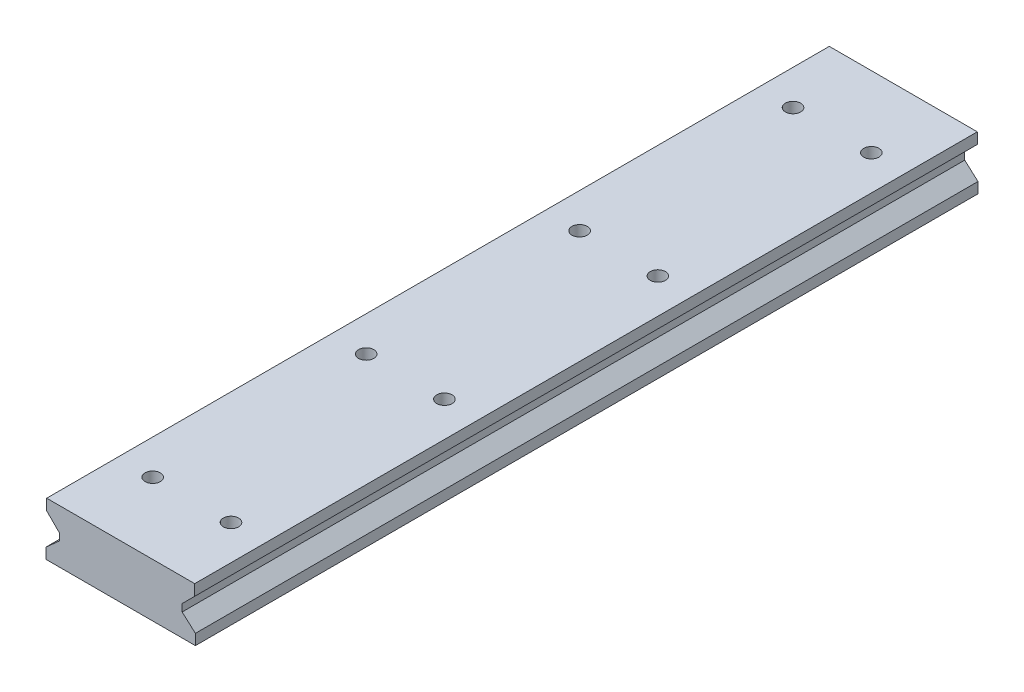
ISO-10303-21;
HEADER;
FILE_DESCRIPTION(('STEP AP214'),'2;1');
FILE_NAME('part.step','',(''),(''),'','','');
FILE_SCHEMA(('AUTOMOTIVE_DESIGN { 1 0 10303 214 1 1 1 1 }'));
ENDSEC;
DATA;
#1=APPLICATION_CONTEXT('core data for automotive mechanical design processes');
#2=APPLICATION_PROTOCOL_DEFINITION('international standard','automotive_design',2000,#1);
#3=PRODUCT_CONTEXT('',#1,'mechanical');
#4=PRODUCT('Part','Part','',(#3));
#5=PRODUCT_RELATED_PRODUCT_CATEGORY('part','',(#4));
#6=PRODUCT_DEFINITION_FORMATION('','',#4);
#7=PRODUCT_DEFINITION_CONTEXT('part definition',#1,'design');
#8=PRODUCT_DEFINITION('design','',#6,#7);
#9=PRODUCT_DEFINITION_SHAPE('','',#8);
#10=(LENGTH_UNIT() NAMED_UNIT(*) SI_UNIT(.MILLI.,.METRE.));
#11=(NAMED_UNIT(*) PLANE_ANGLE_UNIT() SI_UNIT($,.RADIAN.));
#12=(NAMED_UNIT(*) SI_UNIT($,.STERADIAN.) SOLID_ANGLE_UNIT());
#13=UNCERTAINTY_MEASURE_WITH_UNIT(LENGTH_MEASURE(1.E-05),#10,'distance_accuracy_value','');
#14=(GEOMETRIC_REPRESENTATION_CONTEXT(3) GLOBAL_UNCERTAINTY_ASSIGNED_CONTEXT((#13)) GLOBAL_UNIT_ASSIGNED_CONTEXT((#10,
#11,#12)) REPRESENTATION_CONTEXT('',''));
#15=CARTESIAN_POINT('',(0.,0.,0.));
#16=DIRECTION('',(0.,0.,1.));
#17=DIRECTION('',(1.,0.,0.));
#18=AXIS2_PLACEMENT_3D('',#15,#16,#17);
#19=CARTESIAN_POINT('',(-21.,0.,220.));
#20=DIRECTION('',(1.,0.,0.));
#21=DIRECTION('',(0.,0.,-1.));
#22=AXIS2_PLACEMENT_3D('',#19,#20,#21);
#23=PLANE('',#22);
#24=DIRECTION('',(0.,-1.,0.));
#25=VECTOR('',#24,1.);
#26=CARTESIAN_POINT('',(-21.,0.,0.));
#27=LINE('',#26,#25);
#28=CARTESIAN_POINT('',(-21.,3.,0.));
#29=VERTEX_POINT('',#28);
#30=CARTESIAN_POINT('',(-21.,0.,0.));
#31=VERTEX_POINT('',#30);
#32=EDGE_CURVE('E156',#29,#31,#27,.T.);
#33=ORIENTED_EDGE('',*,*,#32,.T.);
#34=DIRECTION('',(0.,0.,-1.));
#35=VECTOR('',#34,1.);
#36=CARTESIAN_POINT('',(-21.,0.,220.));
#37=LINE('',#36,#35);
#38=CARTESIAN_POINT('',(-21.,0.,220.));
#39=VERTEX_POINT('',#38);
#40=EDGE_CURVE('E204',#39,#31,#37,.T.);
#41=ORIENTED_EDGE('',*,*,#40,.F.);
#42=DIRECTION('',(0.,-1.,0.));
#43=VECTOR('',#42,1.);
#44=CARTESIAN_POINT('',(-21.,0.,220.));
#45=LINE('',#44,#43);
#46=CARTESIAN_POINT('',(-21.,3.,220.));
#47=VERTEX_POINT('',#46);
#48=EDGE_CURVE('E179',#47,#39,#45,.T.);
#49=ORIENTED_EDGE('',*,*,#48,.F.);
#50=DIRECTION('',(0.,0.,-1.));
#51=VECTOR('',#50,1.);
#52=CARTESIAN_POINT('',(-21.,3.,220.));
#53=LINE('',#52,#51);
#54=EDGE_CURVE('E152',#47,#29,#53,.T.);
#55=ORIENTED_EDGE('',*,*,#54,.T.);
#56=EDGE_LOOP('',(#33,#41,#49,#55));
#57=FACE_BOUND('',#56,.T.);
#58=ADVANCED_FACE('F34',(#57),#23,.F.);
#59=CARTESIAN_POINT('',(21.,0.,220.));
#60=DIRECTION('',(0.,1.,0.));
#61=DIRECTION('',(0.,0.,1.));
#62=AXIS2_PLACEMENT_3D('',#59,#60,#61);
#63=PLANE('',#62);
#64=CARTESIAN_POINT('',(-11.,0.,140.));
#65=DIRECTION('',(0.,-1.,0.));
#66=DIRECTION('',(0.,0.,-1.));
#67=AXIS2_PLACEMENT_3D('',#64,#65,#66);
#68=CIRCLE('',#67,2.15000000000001);
#69=CARTESIAN_POINT('',(-11.,0.,137.85));
#70=VERTEX_POINT('',#69);
#71=EDGE_CURVE('E352',#70,#70,#68,.T.);
#72=ORIENTED_EDGE('',*,*,#71,.F.);
#73=EDGE_LOOP('',(#72));
#74=FACE_BOUND('',#73,.T.);
#75=CARTESIAN_POINT('',(11.,0.,140.));
#76=DIRECTION('',(0.,-1.,0.));
#77=DIRECTION('',(0.,0.,-1.));
#78=AXIS2_PLACEMENT_3D('',#75,#76,#77);
#79=CIRCLE('',#78,2.15000000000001);
#80=CARTESIAN_POINT('',(11.,0.,137.85));
#81=VERTEX_POINT('',#80);
#82=EDGE_CURVE('E347',#81,#81,#79,.T.);
#83=ORIENTED_EDGE('',*,*,#82,.F.);
#84=EDGE_LOOP('',(#83));
#85=FACE_BOUND('',#84,.T.);
#86=CARTESIAN_POINT('',(11.,0.,200.));
#87=DIRECTION('',(0.,-1.,0.));
#88=DIRECTION('',(0.,0.,-1.));
#89=AXIS2_PLACEMENT_3D('',#86,#87,#88);
#90=CIRCLE('',#89,2.15000000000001);
#91=CARTESIAN_POINT('',(11.,0.,197.85));
#92=VERTEX_POINT('',#91);
#93=EDGE_CURVE('E213',#92,#92,#90,.T.);
#94=ORIENTED_EDGE('',*,*,#93,.F.);
#95=EDGE_LOOP('',(#94));
#96=FACE_BOUND('',#95,.T.);
#97=CARTESIAN_POINT('',(-11.,0.,200.));
#98=DIRECTION('',(0.,-1.,0.));
#99=DIRECTION('',(0.,0.,-1.));
#100=AXIS2_PLACEMENT_3D('',#97,#98,#99);
#101=CIRCLE('',#100,2.15000000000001);
#102=CARTESIAN_POINT('',(-11.,0.,197.85));
#103=VERTEX_POINT('',#102);
#104=EDGE_CURVE('E209',#103,#103,#101,.T.);
#105=ORIENTED_EDGE('',*,*,#104,.F.);
#106=EDGE_LOOP('',(#105));
#107=FACE_BOUND('',#106,.T.);
#108=DIRECTION('',(1.,0.,0.));
#109=VECTOR('',#108,1.);
#110=CARTESIAN_POINT('',(21.,0.,0.));
#111=LINE('',#110,#109);
#112=CARTESIAN_POINT('',(21.,0.,0.));
#113=VERTEX_POINT('',#112);
#114=EDGE_CURVE('E159',#31,#113,#111,.T.);
#115=ORIENTED_EDGE('',*,*,#114,.T.);
#116=DIRECTION('',(0.,0.,-1.));
#117=VECTOR('',#116,1.);
#118=CARTESIAN_POINT('',(21.,0.,220.));
#119=LINE('',#118,#117);
#120=CARTESIAN_POINT('',(21.,0.,220.));
#121=VERTEX_POINT('',#120);
#122=EDGE_CURVE('E201',#121,#113,#119,.T.);
#123=ORIENTED_EDGE('',*,*,#122,.F.);
#124=DIRECTION('',(1.,0.,0.));
#125=VECTOR('',#124,1.);
#126=CARTESIAN_POINT('',(21.,0.,220.));
#127=LINE('',#126,#125);
#128=EDGE_CURVE('E107',#39,#121,#127,.T.);
#129=ORIENTED_EDGE('',*,*,#128,.F.);
#130=ORIENTED_EDGE('',*,*,#40,.T.);
#131=EDGE_LOOP('',(#115,#123,#129,#130));
#132=FACE_BOUND('',#131,.T.);
#133=CARTESIAN_POINT('',(11.,0.,80.));
#134=DIRECTION('',(0.,-1.,0.));
#135=DIRECTION('',(0.,0.,-1.));
#136=AXIS2_PLACEMENT_3D('',#133,#134,#135);
#137=CIRCLE('',#136,2.15000000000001);
#138=CARTESIAN_POINT('',(11.,0.,77.85));
#139=VERTEX_POINT('',#138);
#140=EDGE_CURVE('E206',#139,#139,#137,.T.);
#141=ORIENTED_EDGE('',*,*,#140,.F.);
#142=EDGE_LOOP('',(#141));
#143=FACE_BOUND('',#142,.T.);
#144=CARTESIAN_POINT('',(11.,0.,20.));
#145=DIRECTION('',(0.,-1.,0.));
#146=DIRECTION('',(0.,0.,-1.));
#147=AXIS2_PLACEMENT_3D('',#144,#145,#146);
#148=CIRCLE('',#147,2.15000000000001);
#149=CARTESIAN_POINT('',(11.,0.,17.85));
#150=VERTEX_POINT('',#149);
#151=EDGE_CURVE('E219',#150,#150,#148,.T.);
#152=ORIENTED_EDGE('',*,*,#151,.F.);
#153=EDGE_LOOP('',(#152));
#154=FACE_BOUND('',#153,.T.);
#155=CARTESIAN_POINT('',(-11.,0.,80.));
#156=DIRECTION('',(0.,-1.,0.));
#157=DIRECTION('',(0.,0.,-1.));
#158=AXIS2_PLACEMENT_3D('',#155,#156,#157);
#159=CIRCLE('',#158,2.15000000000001);
#160=CARTESIAN_POINT('',(-11.,0.,77.85));
#161=VERTEX_POINT('',#160);
#162=EDGE_CURVE('E225',#161,#161,#159,.T.);
#163=ORIENTED_EDGE('',*,*,#162,.F.);
#164=EDGE_LOOP('',(#163));
#165=FACE_BOUND('',#164,.T.);
#166=CARTESIAN_POINT('',(-11.,0.,20.));
#167=DIRECTION('',(0.,-1.,0.));
#168=DIRECTION('',(0.,0.,-1.));
#169=AXIS2_PLACEMENT_3D('',#166,#167,#168);
#170=CIRCLE('',#169,2.15000000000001);
#171=CARTESIAN_POINT('',(-11.,0.,17.85));
#172=VERTEX_POINT('',#171);
#173=EDGE_CURVE('E43',#172,#172,#170,.T.);
#174=ORIENTED_EDGE('',*,*,#173,.F.);
#175=EDGE_LOOP('',(#174));
#176=FACE_BOUND('',#175,.T.);
#177=ADVANCED_FACE('F235',(#74,#85,#96,#107,#132,#143,#154,#165,#176),#63,.F.);
#178=CARTESIAN_POINT('',(21.,0.,220.));
#179=DIRECTION('',(-1.,0.,0.));
#180=DIRECTION('',(0.,0.,1.));
#181=AXIS2_PLACEMENT_3D('',#178,#179,#180);
#182=PLANE('',#181);
#183=DIRECTION('',(0.,1.,0.));
#184=VECTOR('',#183,1.);
#185=CARTESIAN_POINT('',(21.,0.,0.));
#186=LINE('',#185,#184);
#187=CARTESIAN_POINT('',(21.,3.,0.));
#188=VERTEX_POINT('',#187);
#189=EDGE_CURVE('E162',#113,#188,#186,.T.);
#190=ORIENTED_EDGE('',*,*,#189,.T.);
#191=DIRECTION('',(0.,0.,-1.));
#192=VECTOR('',#191,1.);
#193=CARTESIAN_POINT('',(21.,3.,220.));
#194=LINE('',#193,#192);
#195=CARTESIAN_POINT('',(21.,3.,220.));
#196=VERTEX_POINT('',#195);
#197=EDGE_CURVE('E198',#196,#188,#194,.T.);
#198=ORIENTED_EDGE('',*,*,#197,.F.);
#199=DIRECTION('',(0.,1.,0.));
#200=VECTOR('',#199,1.);
#201=CARTESIAN_POINT('',(21.,0.,220.));
#202=LINE('',#201,#200);
#203=EDGE_CURVE('E336',#121,#196,#202,.T.);
#204=ORIENTED_EDGE('',*,*,#203,.F.);
#205=ORIENTED_EDGE('',*,*,#122,.T.);
#206=EDGE_LOOP('',(#190,#198,#204,#205));
#207=FACE_BOUND('',#206,.T.);
#208=ADVANCED_FACE('F237',(#207),#182,.F.);
#209=CARTESIAN_POINT('',(17.2689267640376,6.32852707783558,220.));
#210=DIRECTION('',(-0.665705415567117,-0.74621464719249,0.));
#211=DIRECTION('',(0.74621464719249,-0.665705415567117,0.));
#212=AXIS2_PLACEMENT_3D('',#209,#210,#211);
#213=PLANE('',#212);
#214=DIRECTION('',(-0.74621464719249,0.665705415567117,0.));
#215=VECTOR('',#214,1.);
#216=CARTESIAN_POINT('',(17.2689267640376,6.32852707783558,0.));
#217=LINE('',#216,#215);
#218=CARTESIAN_POINT('',(17.2689267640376,6.32852707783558,0.));
#219=VERTEX_POINT('',#218);
#220=EDGE_CURVE('E164',#188,#219,#217,.T.);
#221=ORIENTED_EDGE('',*,*,#220,.T.);
#222=DIRECTION('',(0.,0.,-1.));
#223=VECTOR('',#222,1.);
#224=CARTESIAN_POINT('',(17.2689267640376,6.32852707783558,220.));
#225=LINE('',#224,#223);
#226=CARTESIAN_POINT('',(17.2689267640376,6.32852707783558,220.));
#227=VERTEX_POINT('',#226);
#228=EDGE_CURVE('E195',#227,#219,#225,.T.);
#229=ORIENTED_EDGE('',*,*,#228,.F.);
#230=DIRECTION('',(-0.74621464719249,0.665705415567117,0.));
#231=VECTOR('',#230,1.);
#232=CARTESIAN_POINT('',(17.2689267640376,6.32852707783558,220.));
#233=LINE('',#232,#231);
#234=EDGE_CURVE('E334',#196,#227,#233,.T.);
#235=ORIENTED_EDGE('',*,*,#234,.F.);
#236=ORIENTED_EDGE('',*,*,#197,.T.);
#237=EDGE_LOOP('',(#221,#229,#235,#236));
#238=FACE_BOUND('',#237,.T.);
#239=ADVANCED_FACE('F244',(#238),#213,.F.);
#240=CARTESIAN_POINT('',(17.2689267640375,8.38189648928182,220.));
#241=DIRECTION('',(-1.,0.,0.));
#242=DIRECTION('',(0.,-1.,0.));
#243=AXIS2_PLACEMENT_3D('',#240,#241,#242);
#244=PLANE('',#243);
#245=DIRECTION('',(0.,1.,0.));
#246=VECTOR('',#245,1.);
#247=CARTESIAN_POINT('',(17.2689267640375,8.38189648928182,0.));
#248=LINE('',#247,#246);
#249=CARTESIAN_POINT('',(17.2689267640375,8.38189648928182,0.));
#250=VERTEX_POINT('',#249);
#251=EDGE_CURVE('E166',#219,#250,#248,.T.);
#252=ORIENTED_EDGE('',*,*,#251,.T.);
#253=DIRECTION('',(0.,0.,-1.));
#254=VECTOR('',#253,1.);
#255=CARTESIAN_POINT('',(17.2689267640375,8.38189648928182,220.));
#256=LINE('',#255,#254);
#257=CARTESIAN_POINT('',(17.2689267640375,8.38189648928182,220.));
#258=VERTEX_POINT('',#257);
#259=EDGE_CURVE('E192',#258,#250,#256,.T.);
#260=ORIENTED_EDGE('',*,*,#259,.F.);
#261=DIRECTION('',(0.,1.,0.));
#262=VECTOR('',#261,1.);
#263=CARTESIAN_POINT('',(17.2689267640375,8.38189648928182,220.));
#264=LINE('',#263,#262);
#265=EDGE_CURVE('E315',#227,#258,#264,.T.);
#266=ORIENTED_EDGE('',*,*,#265,.F.);
#267=ORIENTED_EDGE('',*,*,#228,.T.);
#268=EDGE_LOOP('',(#252,#260,#266,#267));
#269=FACE_BOUND('',#268,.T.);
#270=ADVANCED_FACE('F298',(#269),#244,.F.);
#271=CARTESIAN_POINT('',(20.8044606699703,11.9174303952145,220.));
#272=DIRECTION('',(-0.707106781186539,0.707106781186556,0.));
#273=DIRECTION('',(-0.707106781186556,-0.707106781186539,0.));
#274=AXIS2_PLACEMENT_3D('',#271,#272,#273);
#275=PLANE('',#274);
#276=DIRECTION('',(0.707106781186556,0.707106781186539,0.));
#277=VECTOR('',#276,1.);
#278=CARTESIAN_POINT('',(20.8044606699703,11.9174303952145,0.));
#279=LINE('',#278,#277);
#280=CARTESIAN_POINT('',(20.8044606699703,11.9174303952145,0.));
#281=VERTEX_POINT('',#280);
#282=EDGE_CURVE('E168',#250,#281,#279,.T.);
#283=ORIENTED_EDGE('',*,*,#282,.T.);
#284=DIRECTION('',(0.,0.,-1.));
#285=VECTOR('',#284,1.);
#286=CARTESIAN_POINT('',(20.8044606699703,11.9174303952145,220.));
#287=LINE('',#286,#285);
#288=CARTESIAN_POINT('',(20.8044606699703,11.9174303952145,220.));
#289=VERTEX_POINT('',#288);
#290=EDGE_CURVE('E189',#289,#281,#287,.T.);
#291=ORIENTED_EDGE('',*,*,#290,.F.);
#292=DIRECTION('',(0.707106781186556,0.707106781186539,0.));
#293=VECTOR('',#292,1.);
#294=CARTESIAN_POINT('',(20.8044606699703,11.9174303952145,220.));
#295=LINE('',#294,#293);
#296=EDGE_CURVE('E328',#258,#289,#295,.T.);
#297=ORIENTED_EDGE('',*,*,#296,.F.);
#298=ORIENTED_EDGE('',*,*,#259,.T.);
#299=EDGE_LOOP('',(#283,#291,#297,#298));
#300=FACE_BOUND('',#299,.T.);
#301=ADVANCED_FACE('F289',(#300),#275,.F.);
#302=CARTESIAN_POINT('',(20.8044606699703,15.,220.));
#303=DIRECTION('',(-1.,0.,0.));
#304=DIRECTION('',(0.,0.,1.));
#305=AXIS2_PLACEMENT_3D('',#302,#303,#304);
#306=PLANE('',#305);
#307=DIRECTION('',(0.,1.,0.));
#308=VECTOR('',#307,1.);
#309=CARTESIAN_POINT('',(20.8044606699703,15.,0.));
#310=LINE('',#309,#308);
#311=CARTESIAN_POINT('',(20.8044606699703,15.,0.));
#312=VERTEX_POINT('',#311);
#313=EDGE_CURVE('E170',#281,#312,#310,.T.);
#314=ORIENTED_EDGE('',*,*,#313,.T.);
#315=DIRECTION('',(0.,0.,-1.));
#316=VECTOR('',#315,1.);
#317=CARTESIAN_POINT('',(20.8044606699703,15.,220.));
#318=LINE('',#317,#316);
#319=CARTESIAN_POINT('',(20.8044606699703,15.,220.));
#320=VERTEX_POINT('',#319);
#321=EDGE_CURVE('E186',#320,#312,#318,.T.);
#322=ORIENTED_EDGE('',*,*,#321,.F.);
#323=DIRECTION('',(0.,1.,0.));
#324=VECTOR('',#323,1.);
#325=CARTESIAN_POINT('',(20.8044606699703,15.,220.));
#326=LINE('',#325,#324);
#327=EDGE_CURVE('E325',#289,#320,#326,.T.);
#328=ORIENTED_EDGE('',*,*,#327,.F.);
#329=ORIENTED_EDGE('',*,*,#290,.T.);
#330=EDGE_LOOP('',(#314,#322,#328,#329));
#331=FACE_BOUND('',#330,.T.);
#332=ADVANCED_FACE('F279',(#331),#306,.F.);
#333=CARTESIAN_POINT('',(-20.8044606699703,15.,220.));
#334=DIRECTION('',(0.,-1.,0.));
#335=DIRECTION('',(0.,0.,-1.));
#336=AXIS2_PLACEMENT_3D('',#333,#334,#335);
#337=PLANE('',#336);
#338=CARTESIAN_POINT('',(-11.,15.,140.));
#339=DIRECTION('',(0.,-1.,0.));
#340=DIRECTION('',(0.,0.,-1.));
#341=AXIS2_PLACEMENT_3D('',#338,#339,#340);
#342=CIRCLE('',#341,2.15000000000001);
#343=CARTESIAN_POINT('',(-11.,15.,137.85));
#344=VERTEX_POINT('',#343);
#345=EDGE_CURVE('E350',#344,#344,#342,.T.);
#346=ORIENTED_EDGE('',*,*,#345,.T.);
#347=EDGE_LOOP('',(#346));
#348=FACE_BOUND('',#347,.T.);
#349=CARTESIAN_POINT('',(11.,15.,140.));
#350=DIRECTION('',(0.,-1.,0.));
#351=DIRECTION('',(0.,0.,-1.));
#352=AXIS2_PLACEMENT_3D('',#349,#350,#351);
#353=CIRCLE('',#352,2.15000000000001);
#354=CARTESIAN_POINT('',(11.,15.,137.85));
#355=VERTEX_POINT('',#354);
#356=EDGE_CURVE('E344',#355,#355,#353,.T.);
#357=ORIENTED_EDGE('',*,*,#356,.T.);
#358=EDGE_LOOP('',(#357));
#359=FACE_BOUND('',#358,.T.);
#360=CARTESIAN_POINT('',(11.,15.,200.));
#361=DIRECTION('',(0.,-1.,0.));
#362=DIRECTION('',(0.,0.,-1.));
#363=AXIS2_PLACEMENT_3D('',#360,#361,#362);
#364=CIRCLE('',#363,2.15000000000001);
#365=CARTESIAN_POINT('',(11.,15.,197.85));
#366=VERTEX_POINT('',#365);
#367=EDGE_CURVE('E210',#366,#366,#364,.T.);
#368=ORIENTED_EDGE('',*,*,#367,.T.);
#369=EDGE_LOOP('',(#368));
#370=FACE_BOUND('',#369,.T.);
#371=CARTESIAN_POINT('',(-11.,15.,200.));
#372=DIRECTION('',(0.,-1.,0.));
#373=DIRECTION('',(0.,0.,-1.));
#374=AXIS2_PLACEMENT_3D('',#371,#372,#373);
#375=CIRCLE('',#374,2.15000000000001);
#376=CARTESIAN_POINT('',(-11.,15.,197.85));
#377=VERTEX_POINT('',#376);
#378=EDGE_CURVE('E160',#377,#377,#375,.T.);
#379=ORIENTED_EDGE('',*,*,#378,.T.);
#380=EDGE_LOOP('',(#379));
#381=FACE_BOUND('',#380,.T.);
#382=DIRECTION('',(-1.,0.,0.));
#383=VECTOR('',#382,1.);
#384=CARTESIAN_POINT('',(-20.8044606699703,15.,0.));
#385=LINE('',#384,#383);
#386=CARTESIAN_POINT('',(-20.8044606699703,15.,0.));
#387=VERTEX_POINT('',#386);
#388=EDGE_CURVE('E172',#312,#387,#385,.T.);
#389=ORIENTED_EDGE('',*,*,#388,.T.);
#390=DIRECTION('',(0.,0.,-1.));
#391=VECTOR('',#390,1.);
#392=CARTESIAN_POINT('',(-20.8044606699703,15.,220.));
#393=LINE('',#392,#391);
#394=CARTESIAN_POINT('',(-20.8044606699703,15.,220.));
#395=VERTEX_POINT('',#394);
#396=EDGE_CURVE('E183',#395,#387,#393,.T.);
#397=ORIENTED_EDGE('',*,*,#396,.F.);
#398=DIRECTION('',(-1.,0.,0.));
#399=VECTOR('',#398,1.);
#400=CARTESIAN_POINT('',(-20.8044606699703,15.,220.));
#401=LINE('',#400,#399);
#402=EDGE_CURVE('E327',#320,#395,#401,.T.);
#403=ORIENTED_EDGE('',*,*,#402,.F.);
#404=ORIENTED_EDGE('',*,*,#321,.T.);
#405=EDGE_LOOP('',(#389,#397,#403,#404));
#406=FACE_BOUND('',#405,.T.);
#407=CARTESIAN_POINT('',(11.,15.,80.));
#408=DIRECTION('',(0.,-1.,0.));
#409=DIRECTION('',(0.,0.,-1.));
#410=AXIS2_PLACEMENT_3D('',#407,#408,#409);
#411=CIRCLE('',#410,2.15000000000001);
#412=CARTESIAN_POINT('',(11.,15.,77.85));
#413=VERTEX_POINT('',#412);
#414=EDGE_CURVE('E216',#413,#413,#411,.T.);
#415=ORIENTED_EDGE('',*,*,#414,.T.);
#416=EDGE_LOOP('',(#415));
#417=FACE_BOUND('',#416,.T.);
#418=CARTESIAN_POINT('',(11.,15.,20.));
#419=DIRECTION('',(0.,-1.,0.));
#420=DIRECTION('',(0.,0.,-1.));
#421=AXIS2_PLACEMENT_3D('',#418,#419,#420);
#422=CIRCLE('',#421,2.15000000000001);
#423=CARTESIAN_POINT('',(11.,15.,17.85));
#424=VERTEX_POINT('',#423);
#425=EDGE_CURVE('E222',#424,#424,#422,.T.);
#426=ORIENTED_EDGE('',*,*,#425,.T.);
#427=EDGE_LOOP('',(#426));
#428=FACE_BOUND('',#427,.T.);
#429=CARTESIAN_POINT('',(-11.,15.,80.));
#430=DIRECTION('',(0.,-1.,0.));
#431=DIRECTION('',(0.,0.,-1.));
#432=AXIS2_PLACEMENT_3D('',#429,#430,#431);
#433=CIRCLE('',#432,2.15000000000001);
#434=CARTESIAN_POINT('',(-11.,15.,77.85));
#435=VERTEX_POINT('',#434);
#436=EDGE_CURVE('E228',#435,#435,#433,.T.);
#437=ORIENTED_EDGE('',*,*,#436,.T.);
#438=EDGE_LOOP('',(#437));
#439=FACE_BOUND('',#438,.T.);
#440=CARTESIAN_POINT('',(-11.,15.,20.));
#441=DIRECTION('',(0.,-1.,0.));
#442=DIRECTION('',(0.,0.,-1.));
#443=AXIS2_PLACEMENT_3D('',#440,#441,#442);
#444=CIRCLE('',#443,2.15000000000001);
#445=CARTESIAN_POINT('',(-11.,15.,17.85));
#446=VERTEX_POINT('',#445);
#447=EDGE_CURVE('E11',#446,#446,#444,.T.);
#448=ORIENTED_EDGE('',*,*,#447,.T.);
#449=EDGE_LOOP('',(#448));
#450=FACE_BOUND('',#449,.T.);
#451=ADVANCED_FACE('F275',(#348,#359,#370,#381,#406,#417,#428,#439,#450),#337,.F.);
#452=CARTESIAN_POINT('',(-20.8044606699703,15.,220.));
#453=DIRECTION('',(1.,0.,0.));
#454=DIRECTION('',(0.,0.,-1.));
#455=AXIS2_PLACEMENT_3D('',#452,#453,#454);
#456=PLANE('',#455);
#457=DIRECTION('',(0.,-1.,0.));
#458=VECTOR('',#457,1.);
#459=CARTESIAN_POINT('',(-20.8044606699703,15.,0.));
#460=LINE('',#459,#458);
#461=CARTESIAN_POINT('',(-20.8044606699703,11.9174303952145,0.));
#462=VERTEX_POINT('',#461);
#463=EDGE_CURVE('E174',#387,#462,#460,.T.);
#464=ORIENTED_EDGE('',*,*,#463,.T.);
#465=DIRECTION('',(0.,0.,-1.));
#466=VECTOR('',#465,1.);
#467=CARTESIAN_POINT('',(-20.8044606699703,11.9174303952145,220.));
#468=LINE('',#467,#466);
#469=CARTESIAN_POINT('',(-20.8044606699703,11.9174303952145,220.));
#470=VERTEX_POINT('',#469);
#471=EDGE_CURVE('E147',#470,#462,#468,.T.);
#472=ORIENTED_EDGE('',*,*,#471,.F.);
#473=DIRECTION('',(0.,-1.,0.));
#474=VECTOR('',#473,1.);
#475=CARTESIAN_POINT('',(-20.8044606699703,15.,220.));
#476=LINE('',#475,#474);
#477=EDGE_CURVE('E138',#395,#470,#476,.T.);
#478=ORIENTED_EDGE('',*,*,#477,.F.);
#479=ORIENTED_EDGE('',*,*,#396,.T.);
#480=EDGE_LOOP('',(#464,#472,#478,#479));
#481=FACE_BOUND('',#480,.T.);
#482=ADVANCED_FACE('F278',(#481),#456,.F.);
#483=CARTESIAN_POINT('',(-20.8044606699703,11.9174303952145,220.));
#484=DIRECTION('',(0.707106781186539,0.707106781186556,0.));
#485=DIRECTION('',(-0.707106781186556,0.707106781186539,0.));
#486=AXIS2_PLACEMENT_3D('',#483,#484,#485);
#487=PLANE('',#486);
#488=DIRECTION('',(0.707106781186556,-0.707106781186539,0.));
#489=VECTOR('',#488,1.);
#490=CARTESIAN_POINT('',(-20.8044606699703,11.9174303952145,0.));
#491=LINE('',#490,#489);
#492=CARTESIAN_POINT('',(-17.2689267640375,8.38189648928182,0.));
#493=VERTEX_POINT('',#492);
#494=EDGE_CURVE('E146',#462,#493,#491,.T.);
#495=ORIENTED_EDGE('',*,*,#494,.T.);
#496=DIRECTION('',(0.,0.,-1.));
#497=VECTOR('',#496,1.);
#498=CARTESIAN_POINT('',(-17.2689267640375,8.38189648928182,220.));
#499=LINE('',#498,#497);
#500=CARTESIAN_POINT('',(-17.2689267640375,8.38189648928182,220.));
#501=VERTEX_POINT('',#500);
#502=EDGE_CURVE('E143',#501,#493,#499,.T.);
#503=ORIENTED_EDGE('',*,*,#502,.F.);
#504=DIRECTION('',(0.707106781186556,-0.707106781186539,0.));
#505=VECTOR('',#504,1.);
#506=CARTESIAN_POINT('',(-20.8044606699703,11.9174303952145,220.));
#507=LINE('',#506,#505);
#508=EDGE_CURVE('E132',#470,#501,#507,.T.);
#509=ORIENTED_EDGE('',*,*,#508,.F.);
#510=ORIENTED_EDGE('',*,*,#471,.T.);
#511=EDGE_LOOP('',(#495,#503,#509,#510));
#512=FACE_BOUND('',#511,.T.);
#513=ADVANCED_FACE('F144',(#512),#487,.F.);
#514=CARTESIAN_POINT('',(-17.2689267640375,8.38189648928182,220.));
#515=DIRECTION('',(1.,0.,0.));
#516=DIRECTION('',(0.,1.,0.));
#517=AXIS2_PLACEMENT_3D('',#514,#515,#516);
#518=PLANE('',#517);
#519=DIRECTION('',(0.,-1.,0.));
#520=VECTOR('',#519,1.);
#521=CARTESIAN_POINT('',(-17.2689267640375,8.38189648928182,0.));
#522=LINE('',#521,#520);
#523=CARTESIAN_POINT('',(-17.2689267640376,6.32852707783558,0.));
#524=VERTEX_POINT('',#523);
#525=EDGE_CURVE('E92',#493,#524,#522,.T.);
#526=ORIENTED_EDGE('',*,*,#525,.T.);
#527=DIRECTION('',(0.,0.,-1.));
#528=VECTOR('',#527,1.);
#529=CARTESIAN_POINT('',(-17.2689267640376,6.32852707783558,220.));
#530=LINE('',#529,#528);
#531=CARTESIAN_POINT('',(-17.2689267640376,6.32852707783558,220.));
#532=VERTEX_POINT('',#531);
#533=EDGE_CURVE('E148',#532,#524,#530,.T.);
#534=ORIENTED_EDGE('',*,*,#533,.F.);
#535=DIRECTION('',(0.,-1.,0.));
#536=VECTOR('',#535,1.);
#537=CARTESIAN_POINT('',(-17.2689267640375,8.38189648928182,220.));
#538=LINE('',#537,#536);
#539=EDGE_CURVE('E136',#501,#532,#538,.T.);
#540=ORIENTED_EDGE('',*,*,#539,.F.);
#541=ORIENTED_EDGE('',*,*,#502,.T.);
#542=EDGE_LOOP('',(#526,#534,#540,#541));
#543=FACE_BOUND('',#542,.T.);
#544=ADVANCED_FACE('F150',(#543),#518,.F.);
#545=CARTESIAN_POINT('',(-17.2689267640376,6.32852707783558,220.));
#546=DIRECTION('',(0.665705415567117,-0.74621464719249,0.));
#547=DIRECTION('',(0.74621464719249,0.665705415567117,0.));
#548=AXIS2_PLACEMENT_3D('',#545,#546,#547);
#549=PLANE('',#548);
#550=DIRECTION('',(-0.74621464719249,-0.665705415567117,0.));
#551=VECTOR('',#550,1.);
#552=CARTESIAN_POINT('',(-17.2689267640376,6.32852707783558,0.));
#553=LINE('',#552,#551);
#554=EDGE_CURVE('E98',#524,#29,#553,.T.);
#555=ORIENTED_EDGE('',*,*,#554,.T.);
#556=ORIENTED_EDGE('',*,*,#54,.F.);
#557=DIRECTION('',(-0.74621464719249,-0.665705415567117,0.));
#558=VECTOR('',#557,1.);
#559=CARTESIAN_POINT('',(-17.2689267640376,6.32852707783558,220.));
#560=LINE('',#559,#558);
#561=EDGE_CURVE('E51',#532,#47,#560,.T.);
#562=ORIENTED_EDGE('',*,*,#561,.F.);
#563=ORIENTED_EDGE('',*,*,#533,.T.);
#564=EDGE_LOOP('',(#555,#556,#562,#563));
#565=FACE_BOUND('',#564,.T.);
#566=ADVANCED_FACE('F380',(#565),#549,.F.);
#567=CARTESIAN_POINT('',(-21.,15.,220.));
#568=DIRECTION('',(0.,0.,-1.));
#569=DIRECTION('',(-1.,0.,0.));
#570=AXIS2_PLACEMENT_3D('',#567,#568,#569);
#571=PLANE('',#570);
#572=ORIENTED_EDGE('',*,*,#48,.T.);
#573=ORIENTED_EDGE('',*,*,#128,.T.);
#574=ORIENTED_EDGE('',*,*,#203,.T.);
#575=ORIENTED_EDGE('',*,*,#234,.T.);
#576=ORIENTED_EDGE('',*,*,#265,.T.);
#577=ORIENTED_EDGE('',*,*,#296,.T.);
#578=ORIENTED_EDGE('',*,*,#327,.T.);
#579=ORIENTED_EDGE('',*,*,#402,.T.);
#580=ORIENTED_EDGE('',*,*,#477,.T.);
#581=ORIENTED_EDGE('',*,*,#508,.T.);
#582=ORIENTED_EDGE('',*,*,#539,.T.);
#583=ORIENTED_EDGE('',*,*,#561,.T.);
#584=EDGE_LOOP('',(#572,#573,#574,#575,#576,#577,#578,#579,#580,#581,#582,#583));
#585=FACE_BOUND('',#584,.T.);
#586=ADVANCED_FACE('F134',(#585),#571,.F.);
#587=CARTESIAN_POINT('',(-21.,15.,0.));
#588=DIRECTION('',(0.,0.,-1.));
#589=DIRECTION('',(-1.,0.,0.));
#590=AXIS2_PLACEMENT_3D('',#587,#588,#589);
#591=PLANE('',#590);
#592=ORIENTED_EDGE('',*,*,#32,.F.);
#593=ORIENTED_EDGE('',*,*,#554,.F.);
#594=ORIENTED_EDGE('',*,*,#525,.F.);
#595=ORIENTED_EDGE('',*,*,#494,.F.);
#596=ORIENTED_EDGE('',*,*,#463,.F.);
#597=ORIENTED_EDGE('',*,*,#388,.F.);
#598=ORIENTED_EDGE('',*,*,#313,.F.);
#599=ORIENTED_EDGE('',*,*,#282,.F.);
#600=ORIENTED_EDGE('',*,*,#251,.F.);
#601=ORIENTED_EDGE('',*,*,#220,.F.);
#602=ORIENTED_EDGE('',*,*,#189,.F.);
#603=ORIENTED_EDGE('',*,*,#114,.F.);
#604=EDGE_LOOP('',(#592,#593,#594,#595,#596,#597,#598,#599,#600,#601,#602,#603));
#605=FACE_BOUND('',#604,.T.);
#606=ADVANCED_FACE('F318',(#605),#591,.T.);
#607=CARTESIAN_POINT('',(-11.,30.,200.));
#608=DIRECTION('',(0.,-1.,0.));
#609=DIRECTION('',(0.,0.,-1.));
#610=AXIS2_PLACEMENT_3D('',#607,#608,#609);
#611=CYLINDRICAL_SURFACE('',#610,2.15000000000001);
#612=ORIENTED_EDGE('',*,*,#104,.T.);
#613=EDGE_LOOP('',(#612));
#614=FACE_BOUND('',#613,.T.);
#615=ORIENTED_EDGE('',*,*,#378,.F.);
#616=EDGE_LOOP('',(#615));
#617=FACE_BOUND('',#616,.T.);
#618=ADVANCED_FACE('F418',(#614,#617),#611,.F.);
#619=CARTESIAN_POINT('',(11.,30.,200.));
#620=DIRECTION('',(0.,-1.,0.));
#621=DIRECTION('',(0.,0.,-1.));
#622=AXIS2_PLACEMENT_3D('',#619,#620,#621);
#623=CYLINDRICAL_SURFACE('',#622,2.15000000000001);
#624=ORIENTED_EDGE('',*,*,#93,.T.);
#625=EDGE_LOOP('',(#624));
#626=FACE_BOUND('',#625,.T.);
#627=ORIENTED_EDGE('',*,*,#367,.F.);
#628=EDGE_LOOP('',(#627));
#629=FACE_BOUND('',#628,.T.);
#630=ADVANCED_FACE('F426',(#626,#629),#623,.F.);
#631=CARTESIAN_POINT('',(11.,30.,140.));
#632=DIRECTION('',(0.,-1.,0.));
#633=DIRECTION('',(0.,0.,-1.));
#634=AXIS2_PLACEMENT_3D('',#631,#632,#633);
#635=CYLINDRICAL_SURFACE('',#634,2.15000000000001);
#636=ORIENTED_EDGE('',*,*,#82,.T.);
#637=EDGE_LOOP('',(#636));
#638=FACE_BOUND('',#637,.T.);
#639=ORIENTED_EDGE('',*,*,#356,.F.);
#640=EDGE_LOOP('',(#639));
#641=FACE_BOUND('',#640,.T.);
#642=ADVANCED_FACE('F257',(#638,#641),#635,.F.);
#643=CARTESIAN_POINT('',(11.,30.,80.));
#644=DIRECTION('',(0.,-1.,0.));
#645=DIRECTION('',(0.,0.,-1.));
#646=AXIS2_PLACEMENT_3D('',#643,#644,#645);
#647=CYLINDRICAL_SURFACE('',#646,2.15000000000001);
#648=ORIENTED_EDGE('',*,*,#140,.T.);
#649=EDGE_LOOP('',(#648));
#650=FACE_BOUND('',#649,.T.);
#651=ORIENTED_EDGE('',*,*,#414,.F.);
#652=EDGE_LOOP('',(#651));
#653=FACE_BOUND('',#652,.T.);
#654=ADVANCED_FACE('F253',(#650,#653),#647,.F.);
#655=CARTESIAN_POINT('',(11.,30.,20.));
#656=DIRECTION('',(0.,-1.,0.));
#657=DIRECTION('',(0.,0.,-1.));
#658=AXIS2_PLACEMENT_3D('',#655,#656,#657);
#659=CYLINDRICAL_SURFACE('',#658,2.15000000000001);
#660=ORIENTED_EDGE('',*,*,#151,.T.);
#661=EDGE_LOOP('',(#660));
#662=FACE_BOUND('',#661,.T.);
#663=ORIENTED_EDGE('',*,*,#425,.F.);
#664=EDGE_LOOP('',(#663));
#665=FACE_BOUND('',#664,.T.);
#666=ADVANCED_FACE('F256',(#662,#665),#659,.F.);
#667=CARTESIAN_POINT('',(-11.,30.,140.));
#668=DIRECTION('',(0.,-1.,0.));
#669=DIRECTION('',(0.,0.,-1.));
#670=AXIS2_PLACEMENT_3D('',#667,#668,#669);
#671=CYLINDRICAL_SURFACE('',#670,2.15000000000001);
#672=ORIENTED_EDGE('',*,*,#71,.T.);
#673=EDGE_LOOP('',(#672));
#674=FACE_BOUND('',#673,.T.);
#675=ORIENTED_EDGE('',*,*,#345,.F.);
#676=EDGE_LOOP('',(#675));
#677=FACE_BOUND('',#676,.T.);
#678=ADVANCED_FACE('F260',(#674,#677),#671,.F.);
#679=CARTESIAN_POINT('',(-11.,30.,80.));
#680=DIRECTION('',(0.,-1.,0.));
#681=DIRECTION('',(0.,0.,-1.));
#682=AXIS2_PLACEMENT_3D('',#679,#680,#681);
#683=CYLINDRICAL_SURFACE('',#682,2.15000000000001);
#684=ORIENTED_EDGE('',*,*,#162,.T.);
#685=EDGE_LOOP('',(#684));
#686=FACE_BOUND('',#685,.T.);
#687=ORIENTED_EDGE('',*,*,#436,.F.);
#688=EDGE_LOOP('',(#687));
#689=FACE_BOUND('',#688,.T.);
#690=ADVANCED_FACE('F262',(#686,#689),#683,.F.);
#691=CARTESIAN_POINT('',(-11.,30.,20.));
#692=DIRECTION('',(0.,-1.,0.));
#693=DIRECTION('',(0.,0.,-1.));
#694=AXIS2_PLACEMENT_3D('',#691,#692,#693);
#695=CYLINDRICAL_SURFACE('',#694,2.15000000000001);
#696=ORIENTED_EDGE('',*,*,#173,.T.);
#697=EDGE_LOOP('',(#696));
#698=FACE_BOUND('',#697,.T.);
#699=ORIENTED_EDGE('',*,*,#447,.F.);
#700=EDGE_LOOP('',(#699));
#701=FACE_BOUND('',#700,.T.);
#702=ADVANCED_FACE('F36',(#698,#701),#695,.F.);
#703=CLOSED_SHELL('',(#58,#177,#208,#239,#270,#301,#332,#451,#482,#513,#544,#566,#586,#606,#618,
#630,#642,#654,#666,#678,#690,#702));
#704=MANIFOLD_SOLID_BREP('B2',#703);
#705=ADVANCED_BREP_SHAPE_REPRESENTATION('',(#18,#704),#14);
#706=SHAPE_DEFINITION_REPRESENTATION(#9,#705);
ENDSEC;
END-ISO-10303-21;
